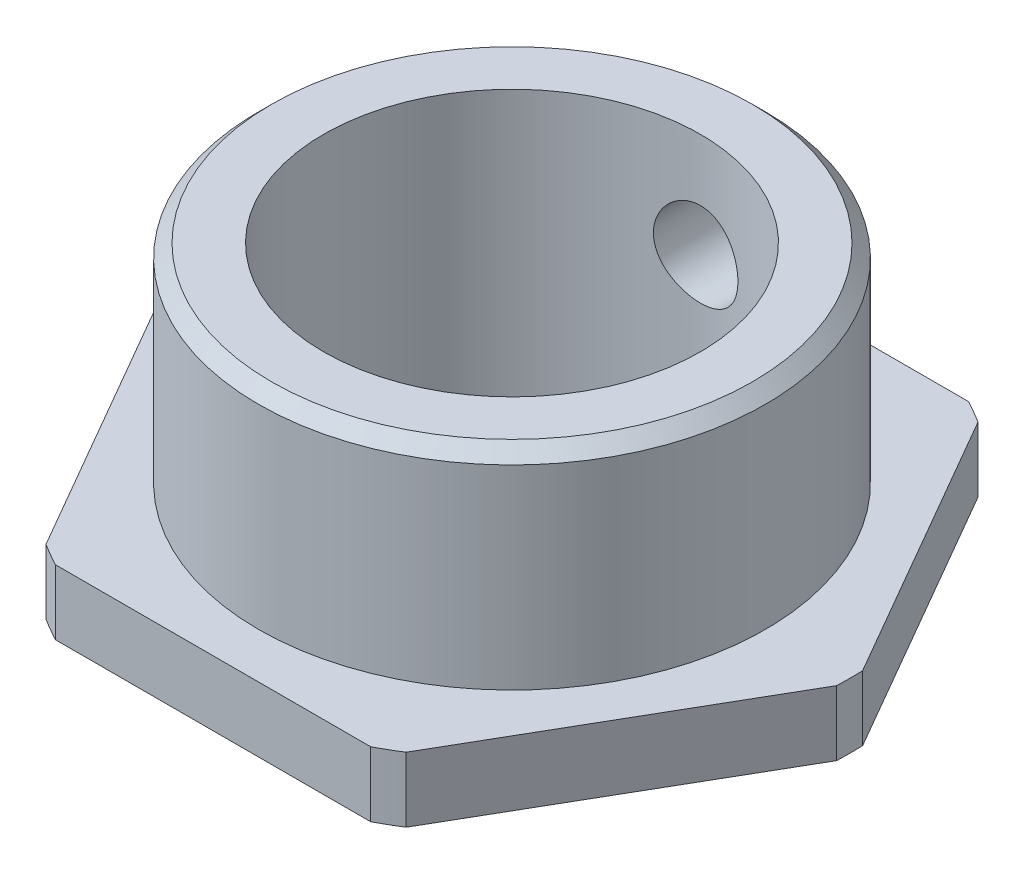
ISO-10303-21;
HEADER;
FILE_DESCRIPTION(('STEP AP214'),'2;1');
FILE_NAME('part.step','',(''),(''),'','','');
FILE_SCHEMA(('AUTOMOTIVE_DESIGN { 1 0 10303 214 1 1 1 1 }'));
ENDSEC;
DATA;
#1=APPLICATION_CONTEXT('core data for automotive mechanical design processes');
#2=APPLICATION_PROTOCOL_DEFINITION('international standard','automotive_design',2000,#1);
#3=PRODUCT_CONTEXT('',#1,'mechanical');
#4=PRODUCT('Part','Part','',(#3));
#5=PRODUCT_RELATED_PRODUCT_CATEGORY('part','',(#4));
#6=PRODUCT_DEFINITION_FORMATION('','',#4);
#7=PRODUCT_DEFINITION_CONTEXT('part definition',#1,'design');
#8=PRODUCT_DEFINITION('design','',#6,#7);
#9=PRODUCT_DEFINITION_SHAPE('','',#8);
#10=(LENGTH_UNIT() NAMED_UNIT(*) SI_UNIT(.MILLI.,.METRE.));
#11=(NAMED_UNIT(*) PLANE_ANGLE_UNIT() SI_UNIT($,.RADIAN.));
#12=(NAMED_UNIT(*) SI_UNIT($,.STERADIAN.) SOLID_ANGLE_UNIT());
#13=UNCERTAINTY_MEASURE_WITH_UNIT(LENGTH_MEASURE(1.E-05),#10,'distance_accuracy_value','');
#14=(GEOMETRIC_REPRESENTATION_CONTEXT(3) GLOBAL_UNCERTAINTY_ASSIGNED_CONTEXT((#13)) GLOBAL_UNIT_ASSIGNED_CONTEXT((#10,
#11,#12)) REPRESENTATION_CONTEXT('',''));
#15=CARTESIAN_POINT('',(0.,0.,0.));
#16=DIRECTION('',(0.,0.,1.));
#17=DIRECTION('',(1.,0.,0.));
#18=AXIS2_PLACEMENT_3D('',#15,#16,#17);
#19=CARTESIAN_POINT('',(0.,16.,0.));
#20=DIRECTION('',(0.,-1.,0.));
#21=DIRECTION('',(0.,0.,-1.));
#22=AXIS2_PLACEMENT_3D('',#19,#20,#21);
#23=CYLINDRICAL_SURFACE('',#22,19.5);
#24=CARTESIAN_POINT('',(0.,0.,0.));
#25=DIRECTION('',(0.,-1.,0.));
#26=DIRECTION('',(0.,0.,-1.));
#27=AXIS2_PLACEMENT_3D('',#24,#25,#26);
#28=CIRCLE('',#27,19.5);
#29=CARTESIAN_POINT('',(0.,0.,-19.5));
#30=VERTEX_POINT('',#29);
#31=EDGE_CURVE('E167',#30,#30,#28,.T.);
#32=ORIENTED_EDGE('',*,*,#31,.F.);
#33=EDGE_LOOP('',(#32));
#34=FACE_BOUND('',#33,.T.);
#35=CARTESIAN_POINT('',(0.,15.,0.));
#36=DIRECTION('',(0.,1.,0.));
#37=DIRECTION('',(0.,0.,1.));
#38=AXIS2_PLACEMENT_3D('',#35,#36,#37);
#39=CIRCLE('',#38,19.5);
#40=CARTESIAN_POINT('',(0.,15.,19.5));
#41=VERTEX_POINT('',#40);
#42=EDGE_CURVE('E173',#41,#41,#39,.F.);
#43=ORIENTED_EDGE('',*,*,#42,.T.);
#44=EDGE_LOOP('',(#43));
#45=FACE_BOUND('',#44,.T.);
#46=CARTESIAN_POINT('',(0.,11.25,-19.5));
#47=CARTESIAN_POINT('',(0.181208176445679,11.2499927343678,-19.4999968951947));
#48=CARTESIAN_POINT('',(0.362515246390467,11.2347935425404,-19.4974478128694));
#49=CARTESIAN_POINT('',(0.720044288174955,11.1744236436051,-19.487524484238));
#50=CARTESIAN_POINT('',(0.896261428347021,11.1292253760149,-19.4801458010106));
#51=CARTESIAN_POINT('',(1.23838617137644,11.0102599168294,-19.4613908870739));
#52=CARTESIAN_POINT('',(1.40430207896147,10.9365160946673,-19.4500179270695));
#53=CARTESIAN_POINT('',(1.72138439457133,10.7626140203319,-19.4245249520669));
#54=CARTESIAN_POINT('',(1.87255248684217,10.6624587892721,-19.4104052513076));
#55=CARTESIAN_POINT('',(2.15731439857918,10.4375583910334,-19.3808331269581));
#56=CARTESIAN_POINT('',(2.29074677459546,10.312610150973,-19.3653703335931));
#57=CARTESIAN_POINT('',(2.53485504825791,10.0421076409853,-19.3349341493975));
#58=CARTESIAN_POINT('',(2.64552950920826,9.89655207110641,-19.3199607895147));
#59=CARTESIAN_POINT('',(2.84162726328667,9.58785774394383,-19.2920983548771));
#60=CARTESIAN_POINT('',(2.9268909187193,9.42461626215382,-19.2792226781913));
#61=CARTESIAN_POINT('',(3.06872587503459,9.08587756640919,-19.2571572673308));
#62=CARTESIAN_POINT('',(3.1252991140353,8.91038118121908,-19.247967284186));
#63=CARTESIAN_POINT('',(3.20763869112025,8.5538256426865,-19.2344169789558));
#64=CARTESIAN_POINT('',(3.23368373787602,8.37283254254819,-19.2300129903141));
#65=CARTESIAN_POINT('',(3.25509174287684,8.00899564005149,-19.2264012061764));
#66=CARTESIAN_POINT('',(3.2504568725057,7.82615196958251,-19.2271930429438));
#67=CARTESIAN_POINT('',(3.210863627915,7.46579378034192,-19.2338435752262));
#68=CARTESIAN_POINT('',(3.17621834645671,7.2882437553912,-19.2396499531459));
#69=CARTESIAN_POINT('',(3.07807908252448,6.94151228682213,-19.2555934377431));
#70=CARTESIAN_POINT('',(3.01458411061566,6.77233113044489,-19.2657306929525));
#71=CARTESIAN_POINT('',(2.86023041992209,6.44620252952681,-19.2892502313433));
#72=CARTESIAN_POINT('',(2.76924168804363,6.28931777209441,-19.3026478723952));
#73=CARTESIAN_POINT('',(2.56257562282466,5.9929242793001,-19.3311679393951));
#74=CARTESIAN_POINT('',(2.44689629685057,5.85341694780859,-19.3462905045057));
#75=CARTESIAN_POINT('',(2.19242687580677,5.59392608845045,-19.3767863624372));
#76=CARTESIAN_POINT('',(2.05336815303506,5.47420592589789,-19.3921604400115));
#77=CARTESIAN_POINT('',(1.75699582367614,5.25975890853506,-19.4212538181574));
#78=CARTESIAN_POINT('',(1.59968209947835,5.16503221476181,-19.4349731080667));
#79=CARTESIAN_POINT('',(1.27101769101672,5.00323710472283,-19.4592306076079));
#80=CARTESIAN_POINT('',(1.09965534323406,4.93619195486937,-19.4697661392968));
#81=CARTESIAN_POINT('',(0.74788784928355,4.83190752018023,-19.4864475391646));
#82=CARTESIAN_POINT('',(0.567483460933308,4.79466574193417,-19.4925937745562));
#83=CARTESIAN_POINT('',(0.20502287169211,4.75140223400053,-19.4997546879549));
#84=CARTESIAN_POINT('',(0.0230109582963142,4.74501895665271,-19.5008287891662));
#85=CARTESIAN_POINT('',(-0.339481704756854,4.76268974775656,-19.4978871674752));
#86=CARTESIAN_POINT('',(-0.519962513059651,4.78674264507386,-19.4938716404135));
#87=CARTESIAN_POINT('',(-0.873153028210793,4.86430230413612,-19.4812387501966));
#88=CARTESIAN_POINT('',(-1.04590312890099,4.91763007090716,-19.472649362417));
#89=CARTESIAN_POINT('',(-1.38001095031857,5.0520348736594,-19.4518280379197));
#90=CARTESIAN_POINT('',(-1.54136803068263,5.13311346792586,-19.4395958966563));
#91=CARTESIAN_POINT('',(-1.84967989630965,5.32154646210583,-19.4126987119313));
#92=CARTESIAN_POINT('',(-1.99649482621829,5.42912670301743,-19.3980131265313));
#93=CARTESIAN_POINT('',(-2.27011666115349,5.66719851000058,-19.3679000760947));
#94=CARTESIAN_POINT('',(-2.39692211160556,5.79769174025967,-19.3524725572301));
#95=CARTESIAN_POINT('',(-2.6282656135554,6.07950681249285,-19.322422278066));
#96=CARTESIAN_POINT('',(-2.73255938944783,6.23103041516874,-19.3078095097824));
#97=CARTESIAN_POINT('',(-2.91421300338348,6.5496588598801,-19.2812298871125));
#98=CARTESIAN_POINT('',(-2.99157369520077,6.71676320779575,-19.2692629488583));
#99=CARTESIAN_POINT('',(-3.11679983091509,7.06112665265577,-19.2494048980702));
#100=CARTESIAN_POINT('',(-3.16478686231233,7.23834052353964,-19.2414970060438));
#101=CARTESIAN_POINT('',(-3.23028608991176,7.59845616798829,-19.2306103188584));
#102=CARTESIAN_POINT('',(-3.24780093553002,7.78135744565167,-19.2276310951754));
#103=CARTESIAN_POINT('',(-3.25178472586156,8.14521671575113,-19.2269575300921));
#104=CARTESIAN_POINT('',(-3.23863817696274,8.32617049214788,-19.2291977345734));
#105=CARTESIAN_POINT('',(-3.1825037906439,8.683253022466,-19.2385671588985));
#106=CARTESIAN_POINT('',(-3.13951604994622,8.85938179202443,-19.2456963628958));
#107=CARTESIAN_POINT('',(-3.02506683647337,9.2016659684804,-19.2640156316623));
#108=CARTESIAN_POINT('',(-2.95363846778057,9.36783271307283,-19.2752009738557));
#109=CARTESIAN_POINT('',(-2.78437510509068,9.6858863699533,-19.3003767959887));
#110=CARTESIAN_POINT('',(-2.68653880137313,9.83777257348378,-19.3143674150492));
#111=CARTESIAN_POINT('',(-2.4658645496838,10.1248962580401,-19.3437849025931));
#112=CARTESIAN_POINT('',(-2.34274373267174,10.2599148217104,-19.3592268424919));
#113=CARTESIAN_POINT('',(-2.0755917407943,10.5075070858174,-19.3896868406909));
#114=CARTESIAN_POINT('',(-1.93155574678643,10.6200755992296,-19.4047048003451));
#115=CARTESIAN_POINT('',(-1.62547992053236,10.8202827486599,-19.4327448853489));
#116=CARTESIAN_POINT('',(-1.46332262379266,10.9077438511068,-19.4457525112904));
#117=CARTESIAN_POINT('',(-1.12646699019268,11.0540503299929,-19.4681651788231));
#118=CARTESIAN_POINT('',(-0.951781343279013,11.1129242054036,-19.4775738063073));
#119=CARTESIAN_POINT('',(-0.647014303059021,11.1876068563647,-19.4896752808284));
#120=CARTESIAN_POINT('',(-0.518776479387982,11.2109668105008,-19.4935263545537));
#121=CARTESIAN_POINT('',(-0.260376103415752,11.2421658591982,-19.4986898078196));
#122=CARTESIAN_POINT('',(-0.130213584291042,11.2500052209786,-19.5000022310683));
#123=CARTESIAN_POINT('',(0.,11.25,-19.5));
#124=B_SPLINE_CURVE_WITH_KNOTS('',3,(#46,#47,#48,#49,#50,#51,#52,#53,#54,#55,#56,#57,#58,#59,
#60,#61,#62,#63,#64,#65,#66,#67,#68,#69,#70,#71,#72,#73,#74,#75,#76,#77,#78,#79,#80,#81,#82,#83,
#84,#85,#86,#87,#88,#89,#90,#91,#92,#93,#94,#95,#96,#97,#98,#99,#100,#101,#102,#103,#104,#105,
#106,#107,#108,#109,#110,#111,#112,#113,#114,#115,#116,#117,#118,#119,#120,#121,#122,#123),
.UNSPECIFIED.,.T.,.F.,(4,2,2,2,2,2,2,2,2,2,2,2,2,2,2,2,2,2,2,2,2,2,2,2,2,2,2,2,2,2,2,2,2,2,2,2,
2,2,4),(0.,0.543148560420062,1.08679680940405,1.63000092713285,2.17314293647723,
2.72093238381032,3.26875640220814,3.81995277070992,4.37111189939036,4.91719900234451,
5.46324745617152,6.00366678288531,6.54410464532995,7.08713923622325,7.63021766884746,
8.18002600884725,8.72983789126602,9.28011095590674,9.83033797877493,10.3741024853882,
10.9178460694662,11.4583014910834,11.9987872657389,12.5440487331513,13.0893498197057,
13.640299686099,14.1912320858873,14.739868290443,15.288456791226,15.8302028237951,
16.3719471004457,16.9130626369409,17.4542050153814,18.0017679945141,18.5494573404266,
19.1009290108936,19.6518497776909,20.0421552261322,20.4324539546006),.UNSPECIFIED.);
#125=CARTESIAN_POINT('',(0.,11.25,-19.5));
#126=VERTEX_POINT('',#125);
#127=EDGE_CURVE('E243',#126,#126,#124,.T.);
#128=ORIENTED_EDGE('',*,*,#127,.F.);
#129=EDGE_LOOP('',(#128));
#130=FACE_BOUND('',#129,.T.);
#131=ADVANCED_FACE('F29',(#34,#45,#130),#23,.T.);
#132=CARTESIAN_POINT('',(0.,-5.,0.));
#133=DIRECTION('',(0.,1.,0.));
#134=DIRECTION('',(0.,0.,1.));
#135=AXIS2_PLACEMENT_3D('',#132,#133,#134);
#136=CYLINDRICAL_SURFACE('',#135,14.5);
#137=CARTESIAN_POINT('',(0.,16.,0.));
#138=DIRECTION('',(0.,1.,0.));
#139=DIRECTION('',(0.,0.,1.));
#140=AXIS2_PLACEMENT_3D('',#137,#138,#139);
#141=CIRCLE('',#140,14.5);
#142=CARTESIAN_POINT('',(0.,16.,14.5));
#143=VERTEX_POINT('',#142);
#144=EDGE_CURVE('E205',#143,#143,#141,.T.);
#145=ORIENTED_EDGE('',*,*,#144,.T.);
#146=EDGE_LOOP('',(#145));
#147=FACE_BOUND('',#146,.T.);
#148=CARTESIAN_POINT('',(0.,-5.,0.));
#149=DIRECTION('',(0.,1.,0.));
#150=DIRECTION('',(0.,0.,1.));
#151=AXIS2_PLACEMENT_3D('',#148,#149,#150);
#152=CIRCLE('',#151,14.5);
#153=CARTESIAN_POINT('',(0.,-5.,14.5));
#154=VERTEX_POINT('',#153);
#155=EDGE_CURVE('E208',#154,#154,#152,.T.);
#156=ORIENTED_EDGE('',*,*,#155,.F.);
#157=EDGE_LOOP('',(#156));
#158=FACE_BOUND('',#157,.T.);
#159=CARTESIAN_POINT('',(0.,4.75,-14.5));
#160=CARTESIAN_POINT('',(0.180140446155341,4.75000599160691,-14.4999966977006));
#161=CARTESIAN_POINT('',(0.360352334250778,4.76502773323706,-14.496609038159));
#162=CARTESIAN_POINT('',(0.715649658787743,4.82465092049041,-14.4834223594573));
#163=CARTESIAN_POINT('',(0.890731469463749,4.86927278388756,-14.473618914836));
#164=CARTESIAN_POINT('',(1.23058317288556,4.98662238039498,-14.4486912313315));
#165=CARTESIAN_POINT('',(1.39536388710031,5.05932002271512,-14.433572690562));
#166=CARTESIAN_POINT('',(1.71038486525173,5.23066030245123,-14.3996429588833));
#167=CARTESIAN_POINT('',(1.86062535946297,5.32930252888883,-14.3808318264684));
#168=CARTESIAN_POINT('',(2.14482993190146,5.55148511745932,-14.3412212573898));
#169=CARTESIAN_POINT('',(2.2785147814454,5.67537810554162,-14.3203961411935));
#170=CARTESIAN_POINT('',(2.52339110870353,5.94378866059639,-14.2792839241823));
#171=CARTESIAN_POINT('',(2.63458049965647,6.08830813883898,-14.2589968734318));
#172=CARTESIAN_POINT('',(2.8325548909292,6.39595083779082,-14.2210037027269));
#173=CARTESIAN_POINT('',(2.91904015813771,6.559271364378,-14.2033304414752));
#174=CARTESIAN_POINT('',(3.06322788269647,6.8985899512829,-14.1729355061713));
#175=CARTESIAN_POINT('',(3.12093396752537,7.07458641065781,-14.1602132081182));
#176=CARTESIAN_POINT('',(3.20499752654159,7.4312249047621,-14.141422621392));
#177=CARTESIAN_POINT('',(3.23185068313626,7.61174444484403,-14.1352492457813));
#178=CARTESIAN_POINT('',(3.25498785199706,7.97482379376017,-14.1299400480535));
#179=CARTESIAN_POINT('',(3.25127581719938,8.15738333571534,-14.1308033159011));
#180=CARTESIAN_POINT('',(3.21378630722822,8.51565719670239,-14.139374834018));
#181=CARTESIAN_POINT('',(3.18058703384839,8.69143564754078,-14.1469514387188));
#182=CARTESIAN_POINT('',(3.08598253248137,9.03486266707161,-14.1678875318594));
#183=CARTESIAN_POINT('',(3.02457565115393,9.20251075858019,-14.1812473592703));
#184=CARTESIAN_POINT('',(2.87477449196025,9.52653122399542,-14.2123728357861));
#185=CARTESIAN_POINT('',(2.78615995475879,9.68279819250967,-14.2301742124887));
#186=CARTESIAN_POINT('',(2.58461365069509,9.97845717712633,-14.2681554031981));
#187=CARTESIAN_POINT('',(2.47167841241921,10.1178467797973,-14.2883355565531));
#188=CARTESIAN_POINT('',(2.22164656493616,10.3791207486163,-14.3293636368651));
#189=CARTESIAN_POINT('',(2.0840588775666,10.5005349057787,-14.3502163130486));
#190=CARTESIAN_POINT('',(1.79023627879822,10.7186448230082,-14.3898226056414));
#191=CARTESIAN_POINT('',(1.63400099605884,10.8153400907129,-14.4085761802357));
#192=CARTESIAN_POINT('',(1.30672838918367,10.9813926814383,-14.4419369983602));
#193=CARTESIAN_POINT('',(1.13565752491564,11.0506859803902,-14.4565345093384));
#194=CARTESIAN_POINT('',(0.783899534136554,11.1594106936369,-14.4798664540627));
#195=CARTESIAN_POINT('',(0.603213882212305,11.1988466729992,-14.4886017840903));
#196=CARTESIAN_POINT('',(0.241386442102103,11.2460478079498,-14.4990967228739));
#197=CARTESIAN_POINT('',(0.060332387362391,11.2544549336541,-14.5009977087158));
#198=CARTESIAN_POINT('',(-0.300593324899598,11.2411031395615,-14.4980070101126));
#199=CARTESIAN_POINT('',(-0.480465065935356,11.2193463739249,-14.4931158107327));
#200=CARTESIAN_POINT('',(-0.831776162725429,11.1468162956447,-14.4771797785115));
#201=CARTESIAN_POINT('',(-1.00328904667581,11.0963819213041,-14.4662068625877));
#202=CARTESIAN_POINT('',(-1.33541939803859,10.9683062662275,-14.4393365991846));
#203=CARTESIAN_POINT('',(-1.49603590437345,10.8906625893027,-14.423438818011));
#204=CARTESIAN_POINT('',(-1.80445241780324,10.7090502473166,-14.3881349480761));
#205=CARTESIAN_POINT('',(-1.95202634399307,10.6047073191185,-14.3686802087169));
#206=CARTESIAN_POINT('',(-2.22780004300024,10.3731487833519,-14.3285156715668));
#207=CARTESIAN_POINT('',(-2.35599716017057,10.2459300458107,-14.3078057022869));
#208=CARTESIAN_POINT('',(-2.5919342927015,9.96927888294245,-14.2669730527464));
#209=CARTESIAN_POINT('',(-2.69922871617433,9.81946306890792,-14.2468695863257));
#210=CARTESIAN_POINT('',(-2.88713853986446,9.50356279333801,-14.2099837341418));
#211=CARTESIAN_POINT('',(-2.96775511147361,9.33747904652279,-14.1932012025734));
#212=CARTESIAN_POINT('',(-3.0994636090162,8.99465692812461,-14.1650225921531));
#213=CARTESIAN_POINT('',(-3.15072434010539,8.81798606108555,-14.1535957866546));
#214=CARTESIAN_POINT('',(-3.22275412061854,8.45824758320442,-14.1373704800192));
#215=CARTESIAN_POINT('',(-3.24352832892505,8.27518105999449,-14.1325708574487));
#216=CARTESIAN_POINT('',(-3.25376731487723,7.91234695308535,-14.1302165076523));
#217=CARTESIAN_POINT('',(-3.24393943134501,7.73260003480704,-14.1324981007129));
#218=CARTESIAN_POINT('',(-3.19484068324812,7.37739398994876,-14.1436775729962));
#219=CARTESIAN_POINT('',(-3.15557020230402,7.20193480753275,-14.1525753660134));
#220=CARTESIAN_POINT('',(-3.04905040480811,6.86088075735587,-14.1759029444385));
#221=CARTESIAN_POINT('',(-2.98190893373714,6.695250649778,-14.1903113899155));
#222=CARTESIAN_POINT('',(-2.82164393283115,6.37750249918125,-14.2230441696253));
#223=CARTESIAN_POINT('',(-2.7285175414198,6.22538594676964,-14.2413689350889));
#224=CARTESIAN_POINT('',(-2.51660132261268,5.93550709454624,-14.2803549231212));
#225=CARTESIAN_POINT('',(-2.39730952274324,5.79811724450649,-14.30105742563));
#226=CARTESIAN_POINT('',(-2.13745979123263,5.5450740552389,-14.3421942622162));
#227=CARTESIAN_POINT('',(-1.99689693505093,5.42942576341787,-14.3626285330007));
#228=CARTESIAN_POINT('',(-1.69616102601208,5.22161833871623,-14.4012607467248));
#229=CARTESIAN_POINT('',(-1.53574454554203,5.12980466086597,-14.4194240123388));
#230=CARTESIAN_POINT('',(-1.20137883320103,4.97459056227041,-14.4511173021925));
#231=CARTESIAN_POINT('',(-1.02744082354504,4.91116686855,-14.4646511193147));
#232=CARTESIAN_POINT('',(-0.711168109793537,4.82553201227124,-14.4832125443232));
#233=CARTESIAN_POINT('',(-0.57051422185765,4.79726268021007,-14.4894681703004));
#234=CARTESIAN_POINT('',(-0.286588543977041,4.75949474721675,-14.4978631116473));
#235=CARTESIAN_POINT('',(-0.143316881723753,4.74999523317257,-14.500002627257));
#236=CARTESIAN_POINT('',(0.,4.75,-14.5));
#237=B_SPLINE_CURVE_WITH_KNOTS('',3,(#159,#160,#161,#162,#163,#164,#165,#166,#167,#168,#169,
#170,#171,#172,#173,#174,#175,#176,#177,#178,#179,#180,#181,#182,#183,#184,#185,#186,#187,#188,
#189,#190,#191,#192,#193,#194,#195,#196,#197,#198,#199,#200,#201,#202,#203,#204,#205,#206,#207,
#208,#209,#210,#211,#212,#213,#214,#215,#216,#217,#218,#219,#220,#221,#222,#223,#224,#225,#226,
#227,#228,#229,#230,#231,#232,#233,#234,#235,#236),.UNSPECIFIED.,.T.,.F.,(4,2,2,2,2,2,2,2,2,2,2,
2,2,2,2,2,2,2,2,2,2,2,2,2,2,2,2,2,2,2,2,2,2,2,2,2,2,2,4),(0.,0.539896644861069,1.08016609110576,
1.61985809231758,2.15954154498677,2.70735342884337,3.25521610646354,3.80946810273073,
4.36365022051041,4.90879856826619,5.45387641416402,5.98849639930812,6.523147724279,
7.06224683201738,7.60142293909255,8.15286127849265,8.70431060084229,9.25704086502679,
9.80968660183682,10.3508321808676,10.8919391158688,11.4267798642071,11.961667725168,
12.5045088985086,13.0474244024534,13.6008826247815,14.1543165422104,14.7045352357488,
15.2546608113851,15.7921659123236,16.3296640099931,16.8651013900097,17.4005977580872,
17.9474407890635,18.4944106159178,19.0489138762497,19.6029617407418,20.0325158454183,
20.4620490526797),.UNSPECIFIED.);
#238=CARTESIAN_POINT('',(0.,4.75,-14.5));
#239=VERTEX_POINT('',#238);
#240=EDGE_CURVE('E33',#239,#239,#237,.T.);
#241=ORIENTED_EDGE('',*,*,#240,.F.);
#242=EDGE_LOOP('',(#241));
#243=FACE_BOUND('',#242,.T.);
#244=ADVANCED_FACE('F263',(#147,#158,#243),#136,.F.);
#245=CARTESIAN_POINT('',(39.8371685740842,0.,23.));
#246=DIRECTION('',(0.,-1.,0.));
#247=DIRECTION('',(0.,0.,-1.));
#248=AXIS2_PLACEMENT_3D('',#245,#246,#247);
#249=PLANE('',#248);
#250=ORIENTED_EDGE('',*,*,#31,.T.);
#251=EDGE_LOOP('',(#250));
#252=FACE_BOUND('',#251,.T.);
#253=CARTESIAN_POINT('',(0.,0.,0.));
#254=DIRECTION('',(0.,1.,0.));
#255=DIRECTION('',(0.,0.,1.));
#256=AXIS2_PLACEMENT_3D('',#253,#254,#255);
#257=CIRCLE('',#256,26.);
#258=CARTESIAN_POINT('',(13.856406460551,0.,-22.));
#259=VERTEX_POINT('',#258);
#260=CARTESIAN_POINT('',(12.1243556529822,0.,-23.));
#261=VERTEX_POINT('',#260);
#262=EDGE_CURVE('E234',#259,#261,#257,.T.);
#263=ORIENTED_EDGE('',*,*,#262,.T.);
#264=DIRECTION('',(1.,0.,0.));
#265=VECTOR('',#264,1.);
#266=CARTESIAN_POINT('',(-13.2790561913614,0.,-23.));
#267=LINE('',#266,#265);
#268=CARTESIAN_POINT('',(-12.1243556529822,0.,-23.));
#269=VERTEX_POINT('',#268);
#270=EDGE_CURVE('E156',#269,#261,#267,.T.);
#271=ORIENTED_EDGE('',*,*,#270,.F.);
#272=CARTESIAN_POINT('',(-13.856406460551,0.,-22.));
#273=VERTEX_POINT('',#272);
#274=EDGE_CURVE('E232',#269,#273,#257,.T.);
#275=ORIENTED_EDGE('',*,*,#274,.T.);
#276=DIRECTION('',(0.5,0.,-0.866025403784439));
#277=VECTOR('',#276,1.);
#278=CARTESIAN_POINT('',(-26.5581123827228,0.,0.));
#279=LINE('',#278,#277);
#280=CARTESIAN_POINT('',(-25.9807621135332,0.,-0.999999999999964));
#281=VERTEX_POINT('',#280);
#282=EDGE_CURVE('E219',#281,#273,#279,.T.);
#283=ORIENTED_EDGE('',*,*,#282,.F.);
#284=CARTESIAN_POINT('',(-25.9807621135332,0.,0.999999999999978));
#285=VERTEX_POINT('',#284);
#286=EDGE_CURVE('E240',#281,#285,#257,.T.);
#287=ORIENTED_EDGE('',*,*,#286,.T.);
#288=DIRECTION('',(-0.5,0.,-0.866025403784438));
#289=VECTOR('',#288,1.);
#290=CARTESIAN_POINT('',(-13.2790561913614,0.,23.));
#291=LINE('',#290,#289);
#292=CARTESIAN_POINT('',(-13.856406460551,0.,22.));
#293=VERTEX_POINT('',#292);
#294=EDGE_CURVE('E191',#293,#285,#291,.T.);
#295=ORIENTED_EDGE('',*,*,#294,.F.);
#296=CARTESIAN_POINT('',(-12.1243556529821,0.,23.));
#297=VERTEX_POINT('',#296);
#298=EDGE_CURVE('E242',#293,#297,#257,.T.);
#299=ORIENTED_EDGE('',*,*,#298,.T.);
#300=DIRECTION('',(-1.,0.,0.));
#301=VECTOR('',#300,1.);
#302=CARTESIAN_POINT('',(13.2790561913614,0.,23.));
#303=LINE('',#302,#301);
#304=CARTESIAN_POINT('',(12.1243556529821,0.,23.));
#305=VERTEX_POINT('',#304);
#306=EDGE_CURVE('E215',#305,#297,#303,.T.);
#307=ORIENTED_EDGE('',*,*,#306,.F.);
#308=CARTESIAN_POINT('',(13.856406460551,0.,22.));
#309=VERTEX_POINT('',#308);
#310=EDGE_CURVE('E134',#305,#309,#257,.T.);
#311=ORIENTED_EDGE('',*,*,#310,.T.);
#312=DIRECTION('',(-0.5,0.,0.866025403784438));
#313=VECTOR('',#312,1.);
#314=CARTESIAN_POINT('',(26.5581123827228,0.,0.));
#315=LINE('',#314,#313);
#316=CARTESIAN_POINT('',(25.9807621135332,0.,0.999999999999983));
#317=VERTEX_POINT('',#316);
#318=EDGE_CURVE('E143',#317,#309,#315,.T.);
#319=ORIENTED_EDGE('',*,*,#318,.F.);
#320=CARTESIAN_POINT('',(25.9807621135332,0.,-0.999999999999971));
#321=VERTEX_POINT('',#320);
#322=EDGE_CURVE('E238',#317,#321,#257,.T.);
#323=ORIENTED_EDGE('',*,*,#322,.T.);
#324=DIRECTION('',(0.5,0.,0.866025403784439));
#325=VECTOR('',#324,1.);
#326=CARTESIAN_POINT('',(13.2790561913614,0.,-23.));
#327=LINE('',#326,#325);
#328=EDGE_CURVE('E211',#259,#321,#327,.T.);
#329=ORIENTED_EDGE('',*,*,#328,.F.);
#330=EDGE_LOOP('',(#263,#271,#275,#283,#287,#295,#299,#307,#311,#319,#323,#329));
#331=FACE_BOUND('',#330,.T.);
#332=ADVANCED_FACE('F230',(#252,#331),#249,.F.);
#333=CARTESIAN_POINT('',(13.2790561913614,-5.,-23.));
#334=DIRECTION('',(-0.866025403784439,0.,0.5));
#335=DIRECTION('',(0.5,0.,0.866025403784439));
#336=AXIS2_PLACEMENT_3D('',#333,#334,#335);
#337=PLANE('',#336);
#338=DIRECTION('',(0.,1.,0.));
#339=VECTOR('',#338,1.);
#340=CARTESIAN_POINT('',(25.9807621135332,-5.,-0.999999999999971));
#341=LINE('',#340,#339);
#342=CARTESIAN_POINT('',(25.9807621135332,-5.,-0.999999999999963));
#343=VERTEX_POINT('',#342);
#344=EDGE_CURVE('E203',#343,#321,#341,.T.);
#345=ORIENTED_EDGE('',*,*,#344,.F.);
#346=DIRECTION('',(0.5,0.,0.866025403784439));
#347=VECTOR('',#346,1.);
#348=CARTESIAN_POINT('',(13.2790561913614,-5.,-23.));
#349=LINE('',#348,#347);
#350=CARTESIAN_POINT('',(13.856406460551,-5.,-22.));
#351=VERTEX_POINT('',#350);
#352=EDGE_CURVE('E152',#351,#343,#349,.T.);
#353=ORIENTED_EDGE('',*,*,#352,.F.);
#354=DIRECTION('',(0.,1.,0.));
#355=VECTOR('',#354,1.);
#356=CARTESIAN_POINT('',(13.856406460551,-5.,-22.));
#357=LINE('',#356,#355);
#358=EDGE_CURVE('E144',#259,#351,#357,.F.);
#359=ORIENTED_EDGE('',*,*,#358,.F.);
#360=ORIENTED_EDGE('',*,*,#328,.T.);
#361=EDGE_LOOP('',(#345,#353,#359,#360));
#362=FACE_BOUND('',#361,.T.);
#363=ADVANCED_FACE('F270',(#362),#337,.F.);
#364=CARTESIAN_POINT('',(26.5581123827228,-5.,0.));
#365=DIRECTION('',(-0.866025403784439,0.,-0.5));
#366=DIRECTION('',(-0.5,0.,0.866025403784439));
#367=AXIS2_PLACEMENT_3D('',#364,#365,#366);
#368=PLANE('',#367);
#369=DIRECTION('',(0.,1.,0.));
#370=VECTOR('',#369,1.);
#371=CARTESIAN_POINT('',(13.856406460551,-5.,22.));
#372=LINE('',#371,#370);
#373=CARTESIAN_POINT('',(13.856406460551,-5.,22.));
#374=VERTEX_POINT('',#373);
#375=EDGE_CURVE('E126',#374,#309,#372,.T.);
#376=ORIENTED_EDGE('',*,*,#375,.F.);
#377=DIRECTION('',(-0.5,0.,0.866025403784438));
#378=VECTOR('',#377,1.);
#379=CARTESIAN_POINT('',(26.5581123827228,-5.,0.));
#380=LINE('',#379,#378);
#381=CARTESIAN_POINT('',(25.9807621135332,-5.,0.999999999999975));
#382=VERTEX_POINT('',#381);
#383=EDGE_CURVE('E141',#382,#374,#380,.T.);
#384=ORIENTED_EDGE('',*,*,#383,.F.);
#385=DIRECTION('',(0.,1.,0.));
#386=VECTOR('',#385,1.);
#387=CARTESIAN_POINT('',(25.9807621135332,-5.,0.999999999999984));
#388=LINE('',#387,#386);
#389=EDGE_CURVE('E145',#317,#382,#388,.F.);
#390=ORIENTED_EDGE('',*,*,#389,.F.);
#391=ORIENTED_EDGE('',*,*,#318,.T.);
#392=EDGE_LOOP('',(#376,#384,#390,#391));
#393=FACE_BOUND('',#392,.T.);
#394=ADVANCED_FACE('F139',(#393),#368,.F.);
#395=CARTESIAN_POINT('',(13.2790561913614,-5.,23.));
#396=DIRECTION('',(0.,0.,-1.));
#397=DIRECTION('',(-1.,0.,0.));
#398=AXIS2_PLACEMENT_3D('',#395,#396,#397);
#399=PLANE('',#398);
#400=DIRECTION('',(0.,1.,0.));
#401=VECTOR('',#400,1.);
#402=CARTESIAN_POINT('',(-12.1243556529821,-5.,23.));
#403=LINE('',#402,#401);
#404=CARTESIAN_POINT('',(-12.1243556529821,-5.,23.));
#405=VERTEX_POINT('',#404);
#406=EDGE_CURVE('E194',#405,#297,#403,.T.);
#407=ORIENTED_EDGE('',*,*,#406,.F.);
#408=DIRECTION('',(-1.,0.,0.));
#409=VECTOR('',#408,1.);
#410=CARTESIAN_POINT('',(13.2790561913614,-5.,23.));
#411=LINE('',#410,#409);
#412=CARTESIAN_POINT('',(12.1243556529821,-5.,23.));
#413=VERTEX_POINT('',#412);
#414=EDGE_CURVE('E151',#413,#405,#411,.T.);
#415=ORIENTED_EDGE('',*,*,#414,.F.);
#416=DIRECTION('',(0.,1.,0.));
#417=VECTOR('',#416,1.);
#418=CARTESIAN_POINT('',(12.1243556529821,-5.,23.));
#419=LINE('',#418,#417);
#420=EDGE_CURVE('E129',#305,#413,#419,.F.);
#421=ORIENTED_EDGE('',*,*,#420,.F.);
#422=ORIENTED_EDGE('',*,*,#306,.T.);
#423=EDGE_LOOP('',(#407,#415,#421,#422));
#424=FACE_BOUND('',#423,.T.);
#425=ADVANCED_FACE('F290',(#424),#399,.F.);
#426=CARTESIAN_POINT('',(-13.2790561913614,-5.,23.));
#427=DIRECTION('',(0.866025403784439,0.,-0.5));
#428=DIRECTION('',(-0.5,0.,-0.866025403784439));
#429=AXIS2_PLACEMENT_3D('',#426,#427,#428);
#430=PLANE('',#429);
#431=DIRECTION('',(0.,1.,0.));
#432=VECTOR('',#431,1.);
#433=CARTESIAN_POINT('',(-25.9807621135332,-5.,0.999999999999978));
#434=LINE('',#433,#432);
#435=CARTESIAN_POINT('',(-25.9807621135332,-5.,0.999999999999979));
#436=VERTEX_POINT('',#435);
#437=EDGE_CURVE('E190',#436,#285,#434,.T.);
#438=ORIENTED_EDGE('',*,*,#437,.F.);
#439=DIRECTION('',(-0.5,0.,-0.866025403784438));
#440=VECTOR('',#439,1.);
#441=CARTESIAN_POINT('',(-13.2790561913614,-5.,23.));
#442=LINE('',#441,#440);
#443=CARTESIAN_POINT('',(-13.856406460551,-5.,22.));
#444=VERTEX_POINT('',#443);
#445=EDGE_CURVE('E154',#444,#436,#442,.T.);
#446=ORIENTED_EDGE('',*,*,#445,.F.);
#447=DIRECTION('',(0.,1.,0.));
#448=VECTOR('',#447,1.);
#449=CARTESIAN_POINT('',(-13.856406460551,-5.,22.));
#450=LINE('',#449,#448);
#451=EDGE_CURVE('E188',#293,#444,#450,.F.);
#452=ORIENTED_EDGE('',*,*,#451,.F.);
#453=ORIENTED_EDGE('',*,*,#294,.T.);
#454=EDGE_LOOP('',(#438,#446,#452,#453));
#455=FACE_BOUND('',#454,.T.);
#456=ADVANCED_FACE('F186',(#455),#430,.F.);
#457=CARTESIAN_POINT('',(-26.5581123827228,-5.,0.));
#458=DIRECTION('',(0.866025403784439,0.,0.5));
#459=DIRECTION('',(0.5,0.,-0.866025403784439));
#460=AXIS2_PLACEMENT_3D('',#457,#458,#459);
#461=PLANE('',#460);
#462=DIRECTION('',(0.,1.,0.));
#463=VECTOR('',#462,1.);
#464=CARTESIAN_POINT('',(-13.856406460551,-5.,-22.));
#465=LINE('',#464,#463);
#466=CARTESIAN_POINT('',(-13.856406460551,-5.,-22.));
#467=VERTEX_POINT('',#466);
#468=EDGE_CURVE('E196',#467,#273,#465,.T.);
#469=ORIENTED_EDGE('',*,*,#468,.F.);
#470=DIRECTION('',(0.5,0.,-0.866025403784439));
#471=VECTOR('',#470,1.);
#472=CARTESIAN_POINT('',(-26.5581123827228,-5.,0.));
#473=LINE('',#472,#471);
#474=CARTESIAN_POINT('',(-25.9807621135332,-5.,-0.999999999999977));
#475=VERTEX_POINT('',#474);
#476=EDGE_CURVE('E162',#475,#467,#473,.T.);
#477=ORIENTED_EDGE('',*,*,#476,.F.);
#478=DIRECTION('',(0.,1.,0.));
#479=VECTOR('',#478,1.);
#480=CARTESIAN_POINT('',(-25.9807621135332,-5.,-0.999999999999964));
#481=LINE('',#480,#479);
#482=EDGE_CURVE('E58',#281,#475,#481,.F.);
#483=ORIENTED_EDGE('',*,*,#482,.F.);
#484=ORIENTED_EDGE('',*,*,#282,.T.);
#485=EDGE_LOOP('',(#469,#477,#483,#484));
#486=FACE_BOUND('',#485,.T.);
#487=ADVANCED_FACE('F252',(#486),#461,.F.);
#488=CARTESIAN_POINT('',(-13.2790561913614,-5.,-23.));
#489=DIRECTION('',(0.,0.,1.));
#490=DIRECTION('',(1.,0.,0.));
#491=AXIS2_PLACEMENT_3D('',#488,#489,#490);
#492=PLANE('',#491);
#493=DIRECTION('',(0.,1.,0.));
#494=VECTOR('',#493,1.);
#495=CARTESIAN_POINT('',(12.1243556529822,-5.,-23.));
#496=LINE('',#495,#494);
#497=CARTESIAN_POINT('',(12.1243556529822,-5.,-23.));
#498=VERTEX_POINT('',#497);
#499=EDGE_CURVE('E226',#498,#261,#496,.T.);
#500=ORIENTED_EDGE('',*,*,#499,.F.);
#501=DIRECTION('',(1.,0.,0.));
#502=VECTOR('',#501,1.);
#503=CARTESIAN_POINT('',(-13.2790561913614,-5.,-23.));
#504=LINE('',#503,#502);
#505=CARTESIAN_POINT('',(-12.1243556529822,-5.,-23.));
#506=VERTEX_POINT('',#505);
#507=EDGE_CURVE('E165',#506,#498,#504,.T.);
#508=ORIENTED_EDGE('',*,*,#507,.F.);
#509=DIRECTION('',(0.,1.,0.));
#510=VECTOR('',#509,1.);
#511=CARTESIAN_POINT('',(-12.1243556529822,-5.,-23.));
#512=LINE('',#511,#510);
#513=EDGE_CURVE('E50',#269,#506,#512,.F.);
#514=ORIENTED_EDGE('',*,*,#513,.F.);
#515=ORIENTED_EDGE('',*,*,#270,.T.);
#516=EDGE_LOOP('',(#500,#508,#514,#515));
#517=FACE_BOUND('',#516,.T.);
#518=ADVANCED_FACE('F225',(#517),#492,.F.);
#519=CARTESIAN_POINT('',(39.8371685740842,-5.,23.));
#520=DIRECTION('',(0.,-1.,0.));
#521=DIRECTION('',(0.,0.,-1.));
#522=AXIS2_PLACEMENT_3D('',#519,#520,#521);
#523=PLANE('',#522);
#524=ORIENTED_EDGE('',*,*,#155,.T.);
#525=EDGE_LOOP('',(#524));
#526=FACE_BOUND('',#525,.T.);
#527=ORIENTED_EDGE('',*,*,#507,.T.);
#528=CARTESIAN_POINT('',(0.,-5.,0.));
#529=DIRECTION('',(0.,-1.,0.));
#530=DIRECTION('',(0.,0.,-1.));
#531=AXIS2_PLACEMENT_3D('',#528,#529,#530);
#532=CIRCLE('',#531,26.);
#533=EDGE_CURVE('E11',#498,#351,#532,.T.);
#534=ORIENTED_EDGE('',*,*,#533,.T.);
#535=ORIENTED_EDGE('',*,*,#352,.T.);
#536=EDGE_CURVE('E42',#343,#382,#532,.T.);
#537=ORIENTED_EDGE('',*,*,#536,.T.);
#538=ORIENTED_EDGE('',*,*,#383,.T.);
#539=CARTESIAN_POINT('',(0.,-5.,0.));
#540=DIRECTION('',(0.,1.,0.));
#541=DIRECTION('',(0.,0.,1.));
#542=AXIS2_PLACEMENT_3D('',#539,#540,#541);
#543=CIRCLE('',#542,26.);
#544=EDGE_CURVE('E123',#413,#374,#543,.T.);
#545=ORIENTED_EDGE('',*,*,#544,.F.);
#546=ORIENTED_EDGE('',*,*,#414,.T.);
#547=EDGE_CURVE('E177',#405,#444,#532,.T.);
#548=ORIENTED_EDGE('',*,*,#547,.T.);
#549=ORIENTED_EDGE('',*,*,#445,.T.);
#550=EDGE_CURVE('E175',#436,#475,#532,.T.);
#551=ORIENTED_EDGE('',*,*,#550,.T.);
#552=ORIENTED_EDGE('',*,*,#476,.T.);
#553=EDGE_CURVE('E43',#467,#506,#532,.T.);
#554=ORIENTED_EDGE('',*,*,#553,.T.);
#555=EDGE_LOOP('',(#527,#534,#535,#537,#538,#545,#546,#548,#549,#551,#552,#554));
#556=FACE_BOUND('',#555,.T.);
#557=ADVANCED_FACE('F149',(#526,#556),#523,.T.);
#558=CARTESIAN_POINT('',(0.,16.,0.));
#559=DIRECTION('',(0.,1.,0.));
#560=DIRECTION('',(0.,0.,1.));
#561=AXIS2_PLACEMENT_3D('',#558,#559,#560);
#562=PLANE('',#561);
#563=CARTESIAN_POINT('',(0.,16.,0.));
#564=DIRECTION('',(0.,1.,0.));
#565=DIRECTION('',(0.,0.,1.));
#566=AXIS2_PLACEMENT_3D('',#563,#564,#565);
#567=CIRCLE('',#566,18.5);
#568=CARTESIAN_POINT('',(0.,16.,18.5));
#569=VERTEX_POINT('',#568);
#570=EDGE_CURVE('E170',#569,#569,#567,.T.);
#571=ORIENTED_EDGE('',*,*,#570,.T.);
#572=EDGE_LOOP('',(#571));
#573=FACE_BOUND('',#572,.T.);
#574=ORIENTED_EDGE('',*,*,#144,.F.);
#575=EDGE_LOOP('',(#574));
#576=FACE_BOUND('',#575,.T.);
#577=ADVANCED_FACE('F282',(#573,#576),#562,.T.);
#578=CARTESIAN_POINT('',(0.,16.,0.));
#579=DIRECTION('',(0.,-1.,0.));
#580=DIRECTION('',(0.,0.,-1.));
#581=AXIS2_PLACEMENT_3D('',#578,#579,#580);
#582=CONICAL_SURFACE('',#581,18.5,0.785398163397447);
#583=ORIENTED_EDGE('',*,*,#42,.F.);
#584=EDGE_LOOP('',(#583));
#585=FACE_BOUND('',#584,.T.);
#586=ORIENTED_EDGE('',*,*,#570,.F.);
#587=EDGE_LOOP('',(#586));
#588=FACE_BOUND('',#587,.T.);
#589=ADVANCED_FACE('F277',(#585,#588),#582,.T.);
#590=CARTESIAN_POINT('',(0.,-5.,0.));
#591=DIRECTION('',(0.,1.,0.));
#592=DIRECTION('',(0.,0.,1.));
#593=AXIS2_PLACEMENT_3D('',#590,#591,#592);
#594=CYLINDRICAL_SURFACE('',#593,26.);
#595=ORIENTED_EDGE('',*,*,#468,.T.);
#596=ORIENTED_EDGE('',*,*,#274,.F.);
#597=ORIENTED_EDGE('',*,*,#513,.T.);
#598=ORIENTED_EDGE('',*,*,#553,.F.);
#599=EDGE_LOOP('',(#595,#596,#597,#598));
#600=FACE_BOUND('',#599,.T.);
#601=ADVANCED_FACE('F250',(#600),#594,.T.);
#602=ORIENTED_EDGE('',*,*,#437,.T.);
#603=ORIENTED_EDGE('',*,*,#286,.F.);
#604=ORIENTED_EDGE('',*,*,#482,.T.);
#605=ORIENTED_EDGE('',*,*,#550,.F.);
#606=EDGE_LOOP('',(#602,#603,#604,#605));
#607=FACE_BOUND('',#606,.T.);
#608=ADVANCED_FACE('F311',(#607),#594,.T.);
#609=ORIENTED_EDGE('',*,*,#406,.T.);
#610=ORIENTED_EDGE('',*,*,#298,.F.);
#611=ORIENTED_EDGE('',*,*,#451,.T.);
#612=ORIENTED_EDGE('',*,*,#547,.F.);
#613=EDGE_LOOP('',(#609,#610,#611,#612));
#614=FACE_BOUND('',#613,.T.);
#615=ADVANCED_FACE('F319',(#614),#594,.T.);
#616=ORIENTED_EDGE('',*,*,#375,.T.);
#617=ORIENTED_EDGE('',*,*,#310,.F.);
#618=ORIENTED_EDGE('',*,*,#420,.T.);
#619=ORIENTED_EDGE('',*,*,#544,.T.);
#620=EDGE_LOOP('',(#616,#617,#618,#619));
#621=FACE_BOUND('',#620,.T.);
#622=ADVANCED_FACE('F125',(#621),#594,.T.);
#623=ORIENTED_EDGE('',*,*,#344,.T.);
#624=ORIENTED_EDGE('',*,*,#322,.F.);
#625=ORIENTED_EDGE('',*,*,#389,.T.);
#626=ORIENTED_EDGE('',*,*,#536,.F.);
#627=EDGE_LOOP('',(#623,#624,#625,#626));
#628=FACE_BOUND('',#627,.T.);
#629=ADVANCED_FACE('F312',(#628),#594,.T.);
#630=ORIENTED_EDGE('',*,*,#358,.T.);
#631=ORIENTED_EDGE('',*,*,#533,.F.);
#632=ORIENTED_EDGE('',*,*,#499,.T.);
#633=ORIENTED_EDGE('',*,*,#262,.F.);
#634=EDGE_LOOP('',(#630,#631,#632,#633));
#635=FACE_BOUND('',#634,.T.);
#636=ADVANCED_FACE('F321',(#635),#594,.T.);
#637=CARTESIAN_POINT('',(0.,8.,-23.));
#638=DIRECTION('',(0.,0.,1.));
#639=DIRECTION('',(0.,-1.,0.));
#640=AXIS2_PLACEMENT_3D('',#637,#638,#639);
#641=CYLINDRICAL_SURFACE('',#640,3.25);
#642=ORIENTED_EDGE('',*,*,#240,.T.);
#643=EDGE_LOOP('',(#642));
#644=FACE_BOUND('',#643,.T.);
#645=ORIENTED_EDGE('',*,*,#127,.T.);
#646=EDGE_LOOP('',(#645));
#647=FACE_BOUND('',#646,.T.);
#648=ADVANCED_FACE('F261',(#644,#647),#641,.F.);
#649=CLOSED_SHELL('',(#131,#244,#332,#363,#394,#425,#456,#487,#518,#557,#577,#589,#601,#608,
#615,#622,#629,#636,#648));
#650=MANIFOLD_SOLID_BREP('B2',#649);
#651=ADVANCED_BREP_SHAPE_REPRESENTATION('',(#18,#650),#14);
#652=SHAPE_DEFINITION_REPRESENTATION(#9,#651);
ENDSEC;
END-ISO-10303-21;
